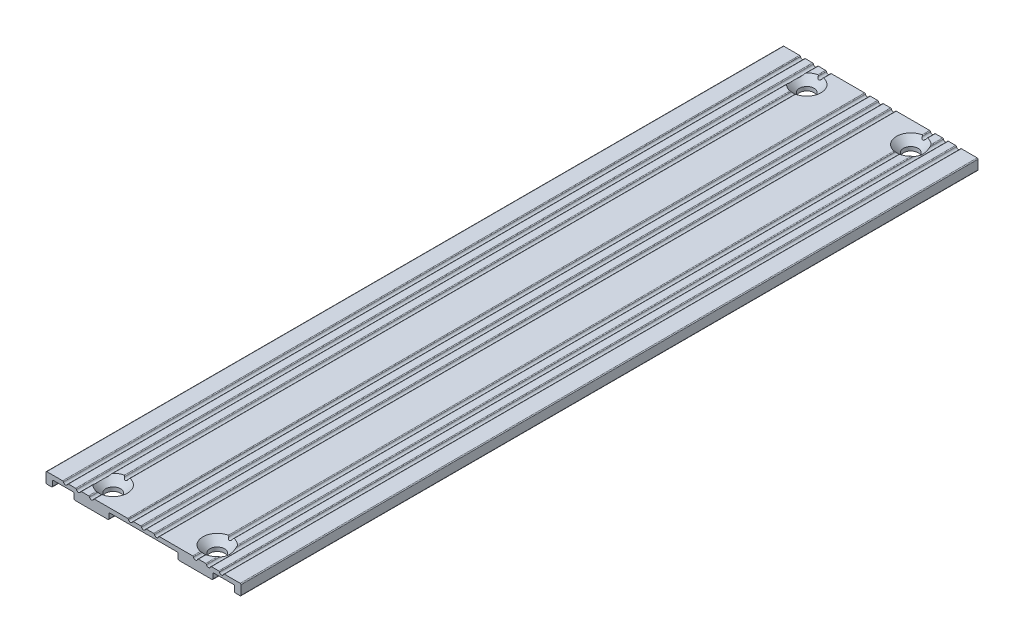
from build123d import *

# Parameters (mm, degrees)
EXTRUDE_1_DEPTH          = 85
HOLE_WIZARD_1_AT_2_COUNT = 2
HOLE_WIZARD_1_AT_2_PITCH = 24
HOLE_WIZARD_1_AT_3_COUNT = 2
HOLE_WIZARD_1_AT_3_PITCH = 160
HOLE_WIZARD_1_AT_4_COUNT = 2
HOLE_WIZARD_1_AT_4_PITCH = 161.789987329
SKETCH_4_W               = 16
SKETCH_4_H               = 1.5
SKETCH_4_W_2             = 5
CUT_EXTRUDE_1_DEPTH      = 177.548942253
FILLET_1_R               = 0.2


with BuildPart() as part:
    # Model → Extrude 1 (new, symmetric)
    with BuildSketch(Plane.XY):
        with BuildLine():
            Line((24.004886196, 6.631868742), (22.346526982, 6.631868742))
            ThreePointArc((22.346526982, 6.631868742), (22.227004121, 6.592225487), (22.154864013, 6.489011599))
            ThreePointArc((22.154864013, 6.489011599), (21.675706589, 6.131868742), (21.196549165, 6.489011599))
            ThreePointArc((21.196549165, 6.489011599), (21.124409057, 6.592225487), (21.004886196, 6.631868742))
            Line((21.004886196, 6.631868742), (13.346526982, 6.631868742))
            ThreePointArc((13.346526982, 6.631868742), (13.227004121, 6.592225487), (13.154864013, 6.489011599))
            ThreePointArc((13.154864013, 6.489011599), (12.675706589, 6.131868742), (12.196549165, 6.489011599))
            ThreePointArc((12.196549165, 6.489011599), (12.124409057, 6.592225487), (12.004886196, 6.631868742))
            Line((12.004886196, 6.631868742), (10.346526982, 6.631868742))
            ThreePointArc((10.346526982, 6.631868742), (10.227004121, 6.592225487), (10.154864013, 6.489011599))
            ThreePointArc((10.154864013, 6.489011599), (9.675706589, 6.131868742), (9.196549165, 6.489011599))
            ThreePointArc((9.196549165, 6.489011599), (9.124409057, 6.592225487), (9.004886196, 6.631868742))
            Line((9.004886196, 6.631868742), (7.346526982, 6.631868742))
            ThreePointArc((7.346526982, 6.631868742), (7.227004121, 6.592225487), (7.154864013, 6.489011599))
            ThreePointArc((7.154864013, 6.489011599), (6.675706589, 6.131868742), (6.196549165, 6.489011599))
            ThreePointArc((6.196549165, 6.489011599), (6.124409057, 6.592225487), (6.004886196, 6.631868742))
            Line((6.004886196, 6.631868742), (2.175706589, 6.631868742))
            Line((2.175706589, 6.631868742), (2.175706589, 4.131868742))
            Line((2.175706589, 4.131868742), (47.175706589, 4.131868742))
            Line((47.175706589, 4.131868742), (47.175706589, 6.631868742))
            Line((47.175706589, 6.631868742), (43.346526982, 6.631868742))
            ThreePointArc((43.346526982, 6.631868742), (43.227004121, 6.592225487), (43.154864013, 6.489011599))
            ThreePointArc((43.154864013, 6.489011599), (42.675706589, 6.131868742), (42.196549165, 6.489011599))
            ThreePointArc((42.196549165, 6.489011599), (42.124409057, 6.592225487), (42.004886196, 6.631868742))
            Line((42.004886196, 6.631868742), (40.346526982, 6.631868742))
            ThreePointArc((40.346526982, 6.631868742), (40.227004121, 6.592225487), (40.154864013, 6.489011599))
            ThreePointArc((40.154864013, 6.489011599), (39.675706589, 6.131868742), (39.196549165, 6.489011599))
            ThreePointArc((39.196549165, 6.489011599), (39.124409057, 6.592225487), (39.004886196, 6.631868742))
            Line((39.004886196, 6.631868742), (37.346526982, 6.631868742))
            ThreePointArc((37.346526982, 6.631868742), (37.227004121, 6.592225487), (37.154864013, 6.489011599))
            ThreePointArc((37.154864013, 6.489011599), (36.675706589, 6.131868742), (36.196549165, 6.489011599))
            ThreePointArc((36.196549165, 6.489011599), (36.124409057, 6.592225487), (36.004886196, 6.631868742))
            Line((36.004886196, 6.631868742), (28.346526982, 6.631868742))
            ThreePointArc((28.346526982, 6.631868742), (28.227004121, 6.592225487), (28.154864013, 6.489011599))
            ThreePointArc((28.154864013, 6.489011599), (27.675706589, 6.131868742), (27.196549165, 6.489011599))
            ThreePointArc((27.196549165, 6.489011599), (27.124409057, 6.592225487), (27.004886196, 6.631868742))
            Line((27.004886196, 6.631868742), (25.346526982, 6.631868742))
            ThreePointArc((25.346526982, 6.631868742), (25.227004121, 6.592225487), (25.154864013, 6.489011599))
            ThreePointArc((25.154864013, 6.489011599), (24.675706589, 6.131868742), (24.196549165, 6.489011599))
            ThreePointArc((24.196549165, 6.489011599), (24.124409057, 6.592225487), (24.004886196, 6.631868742))
        make_face()
    extrude(amount=EXTRUDE_1_DEPTH, both=True)

    # Sketch 2 → Hole Wizard 1 (revolve, cut)
    with BuildSketch(Plane(origin=(12.675706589, 6.631868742, 80), x_dir=(0, 0, 1), z_dir=(1, 0, 0))):
        Polygon((0, 0), (0, 2.5), (1.7, 2.5), (1.7, 1.6), (3.3, 0), align=None)
    hole_wizard_1 = revolve(axis=Axis((12.675706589, 12.981868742, 80), (0, -1, 0)), mode=Mode.SUBTRACT)

    # Hole Wizard 1 at 2: Hole Wizard 1 ×2
    with Locations(*[(i * HOLE_WIZARD_1_AT_2_PITCH, 0, 0) for i in range(1, HOLE_WIZARD_1_AT_2_COUNT)]):
        add(hole_wizard_1, mode=Mode.SUBTRACT)

    # Hole Wizard 1 at 3: Hole Wizard 1 ×2
    with Locations(*[(0, 0, -i * HOLE_WIZARD_1_AT_3_PITCH) for i in range(1, HOLE_WIZARD_1_AT_3_COUNT)]):
        add(hole_wizard_1, mode=Mode.SUBTRACT)

    # Hole Wizard 1 at 4: Hole Wizard 1 ×2
    with Locations(*[Vector(0.14834045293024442, 0, -0.9889363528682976) * (i * HOLE_WIZARD_1_AT_4_PITCH) for i in range(1, HOLE_WIZARD_1_AT_4_COUNT)]):
        add(hole_wizard_1, mode=Mode.SUBTRACT)

    # Sketch 4 → Cut-Extrude 1 (cut, through all)
    with BuildSketch(Plane.XY.offset(85)):
        with Locations((24.675706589, 4.881868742)):
            Rectangle(SKETCH_4_W, SKETCH_4_H)
        with Locations((6.175706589, 4.881868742)):
            Rectangle(SKETCH_4_W_2, SKETCH_4_H)
        with Locations((43.175706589, 4.881868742)):
            Rectangle(SKETCH_4_W_2, SKETCH_4_H)
    extrude(amount=-CUT_EXTRUDE_1_DEPTH, mode=Mode.SUBTRACT)

    # Fillet 1
    fillet_1_edges = [part.edges().sort_by_distance(p)[0] for p in [
        (16.675706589, 4.131868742, 0),
        (16.675706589, 5.631868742, 0),
        (32.675706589, 5.631868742, 0),
        (32.675706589, 4.131868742, 0),
        (3.675706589, 4.131868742, 0),
        (3.675706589, 5.631868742, 0),
        (8.675706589, 5.631868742, 0),
        (8.675706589, 4.131868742, 0),
        (45.675706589, 5.631868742, 0),
        (45.675706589, 4.131868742, 0),
        (40.675706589, 4.131868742, 0),
        (40.675706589, 5.631868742, 0),
        (47.175706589, 6.631868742, 0),
        (47.175706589, 4.131868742, 0),
        (2.175706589, 4.131868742, 0),
        (2.175706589, 6.631868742, 0),
    ]]
    fillet(fillet_1_edges, radius=FILLET_1_R)


solid = part.part
